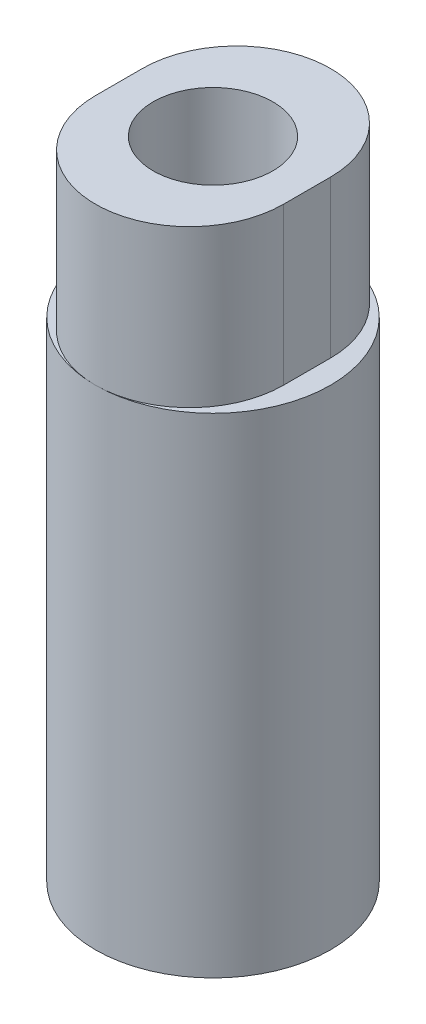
from build123d import *

# Parameters (mm, degrees)
BOSS_EXTRUDE1_DEPTH = 6.35
SKETCH4_R           = 2.4257
CUT_EXTRUDE1_DEPTH  = 28.015052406


with BuildPart() as part:
    # Sketch2 → Base-Revolve (revolve)
    with BuildSketch(Plane.XY, mode=Mode.PRIVATE) as base_revolve_sk:
        Polygon((4.7625, 19.812), (0, 19.812), (0, 5.08), (3.9751, 5.08), (3.9751, 0), (4.7625, 0), align=None)
    revolve(base_revolve_sk.sketch.rotate(Axis((0, 77.724, 0), (0, -1, 0)), 180), axis=Axis((0, 77.724, 0), (0, -1, 0)))

    # Sketch3 → Boss-Extrude1 (add)
    with BuildSketch(Plane(origin=(0, 19.812, 0), x_dir=(-1, 0, 0), z_dir=(0, 1, 0))):
        with BuildLine():
            Line((3.81, -0.9525), (3.81, 0.9525))
            ThreePointArc((3.81, 0.9525), (0, 4.7625), (-3.81, 0.9525))
            Line((-3.81, 0.9525), (-3.81, -0.9525))
            ThreePointArc((-3.81, -0.9525), (0, -4.7625), (3.81, -0.9525))
        make_face()
    extrude(amount=BOSS_EXTRUDE1_DEPTH)

    # Sketch4 → Cut-Extrude1 (cut, through all)
    with BuildSketch(Plane(origin=(0, 26.162, 0), x_dir=(-1, 0, 0), z_dir=(0, 1, 0))):
        Circle(SKETCH4_R)
    extrude(amount=-CUT_EXTRUDE1_DEPTH, mode=Mode.SUBTRACT)


solid = part.part
